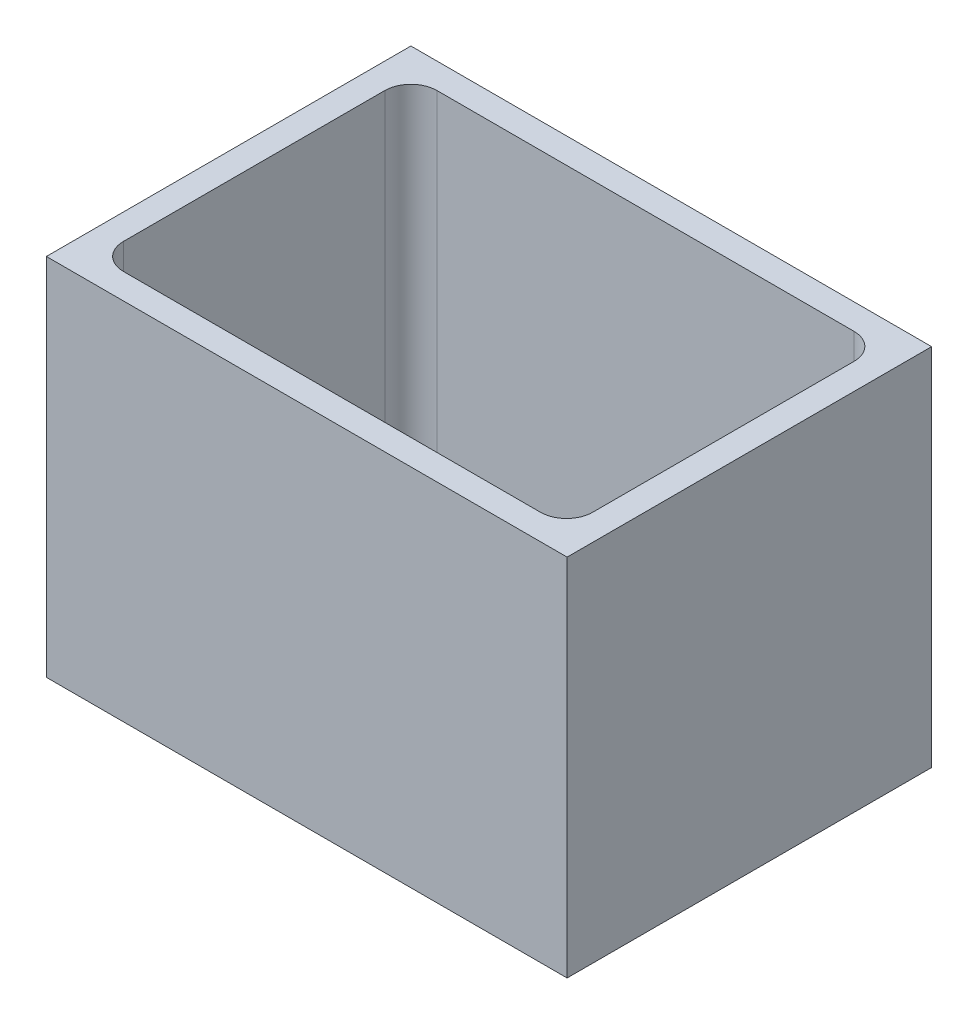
ISO-10303-21;
HEADER;
FILE_DESCRIPTION(('STEP AP214'),'2;1');
FILE_NAME('part.step','',(''),(''),'','','');
FILE_SCHEMA(('AUTOMOTIVE_DESIGN { 1 0 10303 214 1 1 1 1 }'));
ENDSEC;
DATA;
#1=APPLICATION_CONTEXT('core data for automotive mechanical design processes');
#2=APPLICATION_PROTOCOL_DEFINITION('international standard','automotive_design',2000,#1);
#3=PRODUCT_CONTEXT('',#1,'mechanical');
#4=PRODUCT('Part','Part','',(#3));
#5=PRODUCT_RELATED_PRODUCT_CATEGORY('part','',(#4));
#6=PRODUCT_DEFINITION_FORMATION('','',#4);
#7=PRODUCT_DEFINITION_CONTEXT('part definition',#1,'design');
#8=PRODUCT_DEFINITION('design','',#6,#7);
#9=PRODUCT_DEFINITION_SHAPE('','',#8);
#10=(LENGTH_UNIT() NAMED_UNIT(*) SI_UNIT(.MILLI.,.METRE.));
#11=(NAMED_UNIT(*) PLANE_ANGLE_UNIT() SI_UNIT($,.RADIAN.));
#12=(NAMED_UNIT(*) SI_UNIT($,.STERADIAN.) SOLID_ANGLE_UNIT());
#13=UNCERTAINTY_MEASURE_WITH_UNIT(LENGTH_MEASURE(1.E-05),#10,'distance_accuracy_value','');
#14=(GEOMETRIC_REPRESENTATION_CONTEXT(3) GLOBAL_UNCERTAINTY_ASSIGNED_CONTEXT((#13)) GLOBAL_UNIT_ASSIGNED_CONTEXT((#10,
#11,#12)) REPRESENTATION_CONTEXT('',''));
#15=CARTESIAN_POINT('',(0.,0.,0.));
#16=DIRECTION('',(0.,0.,1.));
#17=DIRECTION('',(1.,0.,0.));
#18=AXIS2_PLACEMENT_3D('',#15,#16,#17);
#19=CARTESIAN_POINT('',(-76.2962116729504,88.9,-34.5932753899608));
#20=DIRECTION('',(1.,0.,0.));
#21=DIRECTION('',(0.,0.,-1.));
#22=AXIS2_PLACEMENT_3D('',#19,#20,#21);
#23=PLANE('',#22);
#24=DIRECTION('',(0.,0.,1.));
#25=VECTOR('',#24,1.);
#26=CARTESIAN_POINT('',(-76.2962116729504,0.,-34.5932753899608));
#27=LINE('',#26,#25);
#28=CARTESIAN_POINT('',(-76.2962116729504,0.,-34.5932753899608));
#29=VERTEX_POINT('',#28);
#30=CARTESIAN_POINT('',(-76.2962116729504,0.,54.3067246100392));
#31=VERTEX_POINT('',#30);
#32=EDGE_CURVE('E180',#29,#31,#27,.T.);
#33=ORIENTED_EDGE('',*,*,#32,.T.);
#34=DIRECTION('',(0.,-1.,0.));
#35=VECTOR('',#34,1.);
#36=CARTESIAN_POINT('',(-76.2962116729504,88.9,54.3067246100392));
#37=LINE('',#36,#35);
#38=CARTESIAN_POINT('',(-76.2962116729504,88.9,54.3067246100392));
#39=VERTEX_POINT('',#38);
#40=EDGE_CURVE('E11',#39,#31,#37,.T.);
#41=ORIENTED_EDGE('',*,*,#40,.F.);
#42=DIRECTION('',(0.,0.,1.));
#43=VECTOR('',#42,1.);
#44=CARTESIAN_POINT('',(-76.2962116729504,88.9,-34.5932753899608));
#45=LINE('',#44,#43);
#46=CARTESIAN_POINT('',(-76.2962116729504,88.9,-34.5932753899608));
#47=VERTEX_POINT('',#46);
#48=EDGE_CURVE('E192',#47,#39,#45,.T.);
#49=ORIENTED_EDGE('',*,*,#48,.F.);
#50=DIRECTION('',(0.,-1.,0.));
#51=VECTOR('',#50,1.);
#52=CARTESIAN_POINT('',(-76.2962116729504,88.9,-34.5932753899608));
#53=LINE('',#52,#51);
#54=EDGE_CURVE('E202',#47,#29,#53,.T.);
#55=ORIENTED_EDGE('',*,*,#54,.T.);
#56=EDGE_LOOP('',(#33,#41,#49,#55));
#57=FACE_BOUND('',#56,.T.);
#58=ADVANCED_FACE('F37',(#57),#23,.F.);
#59=CARTESIAN_POINT('',(-76.2962116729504,88.9,54.3067246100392));
#60=DIRECTION('',(0.,0.,-1.));
#61=DIRECTION('',(-1.,0.,0.));
#62=AXIS2_PLACEMENT_3D('',#59,#60,#61);
#63=PLANE('',#62);
#64=DIRECTION('',(1.,0.,0.));
#65=VECTOR('',#64,1.);
#66=CARTESIAN_POINT('',(-76.2962116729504,0.,54.3067246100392));
#67=LINE('',#66,#65);
#68=CARTESIAN_POINT('',(50.7037883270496,0.,54.3067246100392));
#69=VERTEX_POINT('',#68);
#70=EDGE_CURVE('E205',#31,#69,#67,.T.);
#71=ORIENTED_EDGE('',*,*,#70,.T.);
#72=DIRECTION('',(0.,-1.,0.));
#73=VECTOR('',#72,1.);
#74=CARTESIAN_POINT('',(50.7037883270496,88.9,54.3067246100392));
#75=LINE('',#74,#73);
#76=CARTESIAN_POINT('',(50.7037883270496,88.9,54.3067246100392));
#77=VERTEX_POINT('',#76);
#78=EDGE_CURVE('E44',#77,#69,#75,.T.);
#79=ORIENTED_EDGE('',*,*,#78,.F.);
#80=DIRECTION('',(1.,0.,0.));
#81=VECTOR('',#80,1.);
#82=CARTESIAN_POINT('',(-76.2962116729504,88.9,54.3067246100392));
#83=LINE('',#82,#81);
#84=EDGE_CURVE('E195',#39,#77,#83,.T.);
#85=ORIENTED_EDGE('',*,*,#84,.F.);
#86=ORIENTED_EDGE('',*,*,#40,.T.);
#87=EDGE_LOOP('',(#71,#79,#85,#86));
#88=FACE_BOUND('',#87,.T.);
#89=ADVANCED_FACE('F233',(#88),#63,.F.);
#90=CARTESIAN_POINT('',(50.7037883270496,88.9,-34.5932753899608));
#91=DIRECTION('',(-1.,0.,0.));
#92=DIRECTION('',(0.,0.,1.));
#93=AXIS2_PLACEMENT_3D('',#90,#91,#92);
#94=PLANE('',#93);
#95=DIRECTION('',(0.,0.,-1.));
#96=VECTOR('',#95,1.);
#97=CARTESIAN_POINT('',(50.7037883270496,0.,-34.5932753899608));
#98=LINE('',#97,#96);
#99=CARTESIAN_POINT('',(50.7037883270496,0.,-34.5932753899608));
#100=VERTEX_POINT('',#99);
#101=EDGE_CURVE('E207',#69,#100,#98,.T.);
#102=ORIENTED_EDGE('',*,*,#101,.T.);
#103=DIRECTION('',(0.,-1.,0.));
#104=VECTOR('',#103,1.);
#105=CARTESIAN_POINT('',(50.7037883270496,88.9,-34.5932753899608));
#106=LINE('',#105,#104);
#107=CARTESIAN_POINT('',(50.7037883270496,88.9,-34.5932753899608));
#108=VERTEX_POINT('',#107);
#109=EDGE_CURVE('E212',#108,#100,#106,.T.);
#110=ORIENTED_EDGE('',*,*,#109,.F.);
#111=DIRECTION('',(0.,0.,-1.));
#112=VECTOR('',#111,1.);
#113=CARTESIAN_POINT('',(50.7037883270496,88.9,-34.5932753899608));
#114=LINE('',#113,#112);
#115=EDGE_CURVE('E198',#77,#108,#114,.T.);
#116=ORIENTED_EDGE('',*,*,#115,.F.);
#117=ORIENTED_EDGE('',*,*,#78,.T.);
#118=EDGE_LOOP('',(#102,#110,#116,#117));
#119=FACE_BOUND('',#118,.T.);
#120=ADVANCED_FACE('F219',(#119),#94,.F.);
#121=CARTESIAN_POINT('',(-76.2962116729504,88.9,-34.5932753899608));
#122=DIRECTION('',(0.,0.,1.));
#123=DIRECTION('',(1.,0.,0.));
#124=AXIS2_PLACEMENT_3D('',#121,#122,#123);
#125=PLANE('',#124);
#126=DIRECTION('',(-1.,0.,0.));
#127=VECTOR('',#126,1.);
#128=CARTESIAN_POINT('',(-76.2962116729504,0.,-34.5932753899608));
#129=LINE('',#128,#127);
#130=EDGE_CURVE('E196',#100,#29,#129,.T.);
#131=ORIENTED_EDGE('',*,*,#130,.T.);
#132=ORIENTED_EDGE('',*,*,#54,.F.);
#133=DIRECTION('',(-1.,0.,0.));
#134=VECTOR('',#133,1.);
#135=CARTESIAN_POINT('',(-76.2962116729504,88.9,-34.5932753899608));
#136=LINE('',#135,#134);
#137=EDGE_CURVE('E200',#108,#47,#136,.T.);
#138=ORIENTED_EDGE('',*,*,#137,.F.);
#139=ORIENTED_EDGE('',*,*,#109,.T.);
#140=EDGE_LOOP('',(#131,#132,#138,#139));
#141=FACE_BOUND('',#140,.T.);
#142=ADVANCED_FACE('F226',(#141),#125,.F.);
#143=CARTESIAN_POINT('',(0.,88.9,0.));
#144=DIRECTION('',(0.,1.,0.));
#145=DIRECTION('',(0.,0.,1.));
#146=AXIS2_PLACEMENT_3D('',#143,#144,#145);
#147=PLANE('',#146);
#148=CARTESIAN_POINT('',(-63.7232116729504,88.9,-22.0202753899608));
#149=DIRECTION('',(0.,1.,0.));
#150=DIRECTION('',(0.,0.,1.));
#151=AXIS2_PLACEMENT_3D('',#148,#149,#150);
#152=CIRCLE('',#151,6.35);
#153=CARTESIAN_POINT('',(-63.7232116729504,88.9,-28.3702753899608));
#154=VERTEX_POINT('',#153);
#155=CARTESIAN_POINT('',(-70.0732116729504,88.9,-22.0202753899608));
#156=VERTEX_POINT('',#155);
#157=EDGE_CURVE('E51',#154,#156,#152,.T.);
#158=ORIENTED_EDGE('',*,*,#157,.F.);
#159=DIRECTION('',(1.,0.,0.));
#160=VECTOR('',#159,1.);
#161=CARTESIAN_POINT('',(0.,88.9,-28.3702753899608));
#162=LINE('',#161,#160);
#163=CARTESIAN_POINT('',(38.0037883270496,88.9,-28.3702753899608));
#164=VERTEX_POINT('',#163);
#165=EDGE_CURVE('E143',#154,#164,#162,.T.);
#166=ORIENTED_EDGE('',*,*,#165,.T.);
#167=CARTESIAN_POINT('',(38.0037883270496,88.9,-22.0202753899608));
#168=DIRECTION('',(0.,1.,0.));
#169=DIRECTION('',(0.,0.,1.));
#170=AXIS2_PLACEMENT_3D('',#167,#168,#169);
#171=CIRCLE('',#170,6.35);
#172=CARTESIAN_POINT('',(44.3537883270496,88.9,-22.0202753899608));
#173=VERTEX_POINT('',#172);
#174=EDGE_CURVE('E146',#173,#164,#171,.T.);
#175=ORIENTED_EDGE('',*,*,#174,.F.);
#176=DIRECTION('',(0.,0.,1.));
#177=VECTOR('',#176,1.);
#178=CARTESIAN_POINT('',(44.3537883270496,88.9,0.));
#179=LINE('',#178,#177);
#180=CARTESIAN_POINT('',(44.3537883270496,88.9,41.7337246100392));
#181=VERTEX_POINT('',#180);
#182=EDGE_CURVE('E173',#173,#181,#179,.T.);
#183=ORIENTED_EDGE('',*,*,#182,.T.);
#184=CARTESIAN_POINT('',(38.0037883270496,88.9,41.7337246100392));
#185=DIRECTION('',(0.,1.,0.));
#186=DIRECTION('',(0.,0.,1.));
#187=AXIS2_PLACEMENT_3D('',#184,#185,#186);
#188=CIRCLE('',#187,6.35);
#189=CARTESIAN_POINT('',(38.0037883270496,88.9,48.0837246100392));
#190=VERTEX_POINT('',#189);
#191=EDGE_CURVE('E170',#190,#181,#188,.T.);
#192=ORIENTED_EDGE('',*,*,#191,.F.);
#193=DIRECTION('',(1.,0.,0.));
#194=VECTOR('',#193,1.);
#195=CARTESIAN_POINT('',(0.,88.9,48.0837246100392));
#196=LINE('',#195,#194);
#197=CARTESIAN_POINT('',(-63.7232116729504,88.9,48.0837246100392));
#198=VERTEX_POINT('',#197);
#199=EDGE_CURVE('E167',#198,#190,#196,.T.);
#200=ORIENTED_EDGE('',*,*,#199,.F.);
#201=CARTESIAN_POINT('',(-63.7232116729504,88.9,41.7337246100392));
#202=DIRECTION('',(0.,1.,0.));
#203=DIRECTION('',(0.,0.,1.));
#204=AXIS2_PLACEMENT_3D('',#201,#202,#203);
#205=CIRCLE('',#204,6.35);
#206=CARTESIAN_POINT('',(-70.0732116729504,88.9,41.7337246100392));
#207=VERTEX_POINT('',#206);
#208=EDGE_CURVE('E164',#207,#198,#205,.T.);
#209=ORIENTED_EDGE('',*,*,#208,.F.);
#210=DIRECTION('',(0.,0.,1.));
#211=VECTOR('',#210,1.);
#212=CARTESIAN_POINT('',(-70.0732116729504,88.9,0.));
#213=LINE('',#212,#211);
#214=EDGE_CURVE('E162',#156,#207,#213,.T.);
#215=ORIENTED_EDGE('',*,*,#214,.F.);
#216=EDGE_LOOP('',(#158,#166,#175,#183,#192,#200,#209,#215));
#217=FACE_BOUND('',#216,.T.);
#218=ORIENTED_EDGE('',*,*,#48,.T.);
#219=ORIENTED_EDGE('',*,*,#84,.T.);
#220=ORIENTED_EDGE('',*,*,#115,.T.);
#221=ORIENTED_EDGE('',*,*,#137,.T.);
#222=EDGE_LOOP('',(#218,#219,#220,#221));
#223=FACE_BOUND('',#222,.T.);
#224=ADVANCED_FACE('F232',(#217,#223),#147,.T.);
#225=CARTESIAN_POINT('',(0.,0.,0.));
#226=DIRECTION('',(0.,1.,0.));
#227=DIRECTION('',(0.,0.,1.));
#228=AXIS2_PLACEMENT_3D('',#225,#226,#227);
#229=PLANE('',#228);
#230=DIRECTION('',(1.,0.,0.));
#231=VECTOR('',#230,1.);
#232=CARTESIAN_POINT('',(0.,0.,-28.3702753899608));
#233=LINE('',#232,#231);
#234=CARTESIAN_POINT('',(-63.7232116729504,0.,-28.3702753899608));
#235=VERTEX_POINT('',#234);
#236=CARTESIAN_POINT('',(38.0037883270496,0.,-28.3702753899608));
#237=VERTEX_POINT('',#236);
#238=EDGE_CURVE('E133',#235,#237,#233,.T.);
#239=ORIENTED_EDGE('',*,*,#238,.F.);
#240=CARTESIAN_POINT('',(-63.7232116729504,0.,-22.0202753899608));
#241=DIRECTION('',(0.,1.,0.));
#242=DIRECTION('',(0.,0.,1.));
#243=AXIS2_PLACEMENT_3D('',#240,#241,#242);
#244=CIRCLE('',#243,6.35);
#245=CARTESIAN_POINT('',(-70.0732116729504,0.,-22.0202753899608));
#246=VERTEX_POINT('',#245);
#247=EDGE_CURVE('E127',#235,#246,#244,.T.);
#248=ORIENTED_EDGE('',*,*,#247,.T.);
#249=DIRECTION('',(0.,0.,1.));
#250=VECTOR('',#249,1.);
#251=CARTESIAN_POINT('',(-70.0732116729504,0.,0.));
#252=LINE('',#251,#250);
#253=CARTESIAN_POINT('',(-70.0732116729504,0.,41.7337246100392));
#254=VERTEX_POINT('',#253);
#255=EDGE_CURVE('E136',#246,#254,#252,.T.);
#256=ORIENTED_EDGE('',*,*,#255,.T.);
#257=CARTESIAN_POINT('',(-63.7232116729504,0.,41.7337246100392));
#258=DIRECTION('',(0.,1.,0.));
#259=DIRECTION('',(0.,0.,1.));
#260=AXIS2_PLACEMENT_3D('',#257,#258,#259);
#261=CIRCLE('',#260,6.35);
#262=CARTESIAN_POINT('',(-63.7232116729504,0.,48.0837246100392));
#263=VERTEX_POINT('',#262);
#264=EDGE_CURVE('E59',#254,#263,#261,.T.);
#265=ORIENTED_EDGE('',*,*,#264,.T.);
#266=DIRECTION('',(1.,0.,0.));
#267=VECTOR('',#266,1.);
#268=CARTESIAN_POINT('',(0.,0.,48.0837246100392));
#269=LINE('',#268,#267);
#270=CARTESIAN_POINT('',(38.0037883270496,0.,48.0837246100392));
#271=VERTEX_POINT('',#270);
#272=EDGE_CURVE('E150',#263,#271,#269,.T.);
#273=ORIENTED_EDGE('',*,*,#272,.T.);
#274=CARTESIAN_POINT('',(38.0037883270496,0.,41.7337246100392));
#275=DIRECTION('',(0.,1.,0.));
#276=DIRECTION('',(0.,0.,1.));
#277=AXIS2_PLACEMENT_3D('',#274,#275,#276);
#278=CIRCLE('',#277,6.35);
#279=CARTESIAN_POINT('',(44.3537883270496,0.,41.7337246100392));
#280=VERTEX_POINT('',#279);
#281=EDGE_CURVE('E153',#271,#280,#278,.T.);
#282=ORIENTED_EDGE('',*,*,#281,.T.);
#283=DIRECTION('',(0.,0.,1.));
#284=VECTOR('',#283,1.);
#285=CARTESIAN_POINT('',(44.3537883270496,0.,0.));
#286=LINE('',#285,#284);
#287=CARTESIAN_POINT('',(44.3537883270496,0.,-22.0202753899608));
#288=VERTEX_POINT('',#287);
#289=EDGE_CURVE('E156',#288,#280,#286,.T.);
#290=ORIENTED_EDGE('',*,*,#289,.F.);
#291=CARTESIAN_POINT('',(38.0037883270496,0.,-22.0202753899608));
#292=DIRECTION('',(0.,1.,0.));
#293=DIRECTION('',(0.,0.,1.));
#294=AXIS2_PLACEMENT_3D('',#291,#292,#293);
#295=CIRCLE('',#294,6.35);
#296=EDGE_CURVE('E158',#288,#237,#295,.T.);
#297=ORIENTED_EDGE('',*,*,#296,.T.);
#298=EDGE_LOOP('',(#239,#248,#256,#265,#273,#282,#290,#297));
#299=FACE_BOUND('',#298,.T.);
#300=ORIENTED_EDGE('',*,*,#32,.F.);
#301=ORIENTED_EDGE('',*,*,#130,.F.);
#302=ORIENTED_EDGE('',*,*,#101,.F.);
#303=ORIENTED_EDGE('',*,*,#70,.F.);
#304=EDGE_LOOP('',(#300,#301,#302,#303));
#305=FACE_BOUND('',#304,.T.);
#306=ADVANCED_FACE('F140',(#299,#305),#229,.F.);
#307=CARTESIAN_POINT('',(-63.7232116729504,0.,-22.0202753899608));
#308=DIRECTION('',(0.,1.,0.));
#309=DIRECTION('',(0.,0.,1.));
#310=AXIS2_PLACEMENT_3D('',#307,#308,#309);
#311=CYLINDRICAL_SURFACE('',#310,6.35);
#312=ORIENTED_EDGE('',*,*,#157,.T.);
#313=DIRECTION('',(0.,1.,0.));
#314=VECTOR('',#313,1.);
#315=CARTESIAN_POINT('',(-70.0732116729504,0.,-22.0202753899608));
#316=LINE('',#315,#314);
#317=EDGE_CURVE('E123',#246,#156,#316,.T.);
#318=ORIENTED_EDGE('',*,*,#317,.F.);
#319=ORIENTED_EDGE('',*,*,#247,.F.);
#320=DIRECTION('',(0.,1.,0.));
#321=VECTOR('',#320,1.);
#322=CARTESIAN_POINT('',(-63.7232116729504,0.,-28.3702753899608));
#323=LINE('',#322,#321);
#324=EDGE_CURVE('E178',#235,#154,#323,.T.);
#325=ORIENTED_EDGE('',*,*,#324,.T.);
#326=EDGE_LOOP('',(#312,#318,#319,#325));
#327=FACE_BOUND('',#326,.T.);
#328=ADVANCED_FACE('F125',(#327),#311,.F.);
#329=CARTESIAN_POINT('',(0.,0.,-28.3702753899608));
#330=DIRECTION('',(0.,0.,1.));
#331=DIRECTION('',(1.,0.,0.));
#332=AXIS2_PLACEMENT_3D('',#329,#330,#331);
#333=PLANE('',#332);
#334=ORIENTED_EDGE('',*,*,#165,.F.);
#335=ORIENTED_EDGE('',*,*,#324,.F.);
#336=ORIENTED_EDGE('',*,*,#238,.T.);
#337=DIRECTION('',(0.,1.,0.));
#338=VECTOR('',#337,1.);
#339=CARTESIAN_POINT('',(38.0037883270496,0.,-28.3702753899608));
#340=LINE('',#339,#338);
#341=EDGE_CURVE('E181',#237,#164,#340,.T.);
#342=ORIENTED_EDGE('',*,*,#341,.T.);
#343=EDGE_LOOP('',(#334,#335,#336,#342));
#344=FACE_BOUND('',#343,.T.);
#345=ADVANCED_FACE('F250',(#344),#333,.T.);
#346=CARTESIAN_POINT('',(38.0037883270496,0.,-22.0202753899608));
#347=DIRECTION('',(0.,1.,0.));
#348=DIRECTION('',(0.,0.,1.));
#349=AXIS2_PLACEMENT_3D('',#346,#347,#348);
#350=CYLINDRICAL_SURFACE('',#349,6.35);
#351=ORIENTED_EDGE('',*,*,#174,.T.);
#352=ORIENTED_EDGE('',*,*,#341,.F.);
#353=ORIENTED_EDGE('',*,*,#296,.F.);
#354=DIRECTION('',(0.,1.,0.));
#355=VECTOR('',#354,1.);
#356=CARTESIAN_POINT('',(44.3537883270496,0.,-22.0202753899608));
#357=LINE('',#356,#355);
#358=EDGE_CURVE('E183',#288,#173,#357,.T.);
#359=ORIENTED_EDGE('',*,*,#358,.T.);
#360=EDGE_LOOP('',(#351,#352,#353,#359));
#361=FACE_BOUND('',#360,.T.);
#362=ADVANCED_FACE('F267',(#361),#350,.F.);
#363=CARTESIAN_POINT('',(44.3537883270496,0.,0.));
#364=DIRECTION('',(-1.,0.,0.));
#365=DIRECTION('',(0.,0.,1.));
#366=AXIS2_PLACEMENT_3D('',#363,#364,#365);
#367=PLANE('',#366);
#368=ORIENTED_EDGE('',*,*,#182,.F.);
#369=ORIENTED_EDGE('',*,*,#358,.F.);
#370=ORIENTED_EDGE('',*,*,#289,.T.);
#371=DIRECTION('',(0.,1.,0.));
#372=VECTOR('',#371,1.);
#373=CARTESIAN_POINT('',(44.3537883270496,0.,41.7337246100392));
#374=LINE('',#373,#372);
#375=EDGE_CURVE('E185',#280,#181,#374,.T.);
#376=ORIENTED_EDGE('',*,*,#375,.T.);
#377=EDGE_LOOP('',(#368,#369,#370,#376));
#378=FACE_BOUND('',#377,.T.);
#379=ADVANCED_FACE('F263',(#378),#367,.T.);
#380=CARTESIAN_POINT('',(38.0037883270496,0.,41.7337246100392));
#381=DIRECTION('',(0.,1.,0.));
#382=DIRECTION('',(0.,0.,1.));
#383=AXIS2_PLACEMENT_3D('',#380,#381,#382);
#384=CYLINDRICAL_SURFACE('',#383,6.35);
#385=ORIENTED_EDGE('',*,*,#191,.T.);
#386=ORIENTED_EDGE('',*,*,#375,.F.);
#387=ORIENTED_EDGE('',*,*,#281,.F.);
#388=DIRECTION('',(0.,1.,0.));
#389=VECTOR('',#388,1.);
#390=CARTESIAN_POINT('',(38.0037883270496,0.,48.0837246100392));
#391=LINE('',#390,#389);
#392=EDGE_CURVE('E187',#271,#190,#391,.T.);
#393=ORIENTED_EDGE('',*,*,#392,.T.);
#394=EDGE_LOOP('',(#385,#386,#387,#393));
#395=FACE_BOUND('',#394,.T.);
#396=ADVANCED_FACE('F259',(#395),#384,.F.);
#397=CARTESIAN_POINT('',(0.,0.,48.0837246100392));
#398=DIRECTION('',(0.,0.,1.));
#399=DIRECTION('',(1.,0.,0.));
#400=AXIS2_PLACEMENT_3D('',#397,#398,#399);
#401=PLANE('',#400);
#402=ORIENTED_EDGE('',*,*,#199,.T.);
#403=ORIENTED_EDGE('',*,*,#392,.F.);
#404=ORIENTED_EDGE('',*,*,#272,.F.);
#405=DIRECTION('',(0.,1.,0.));
#406=VECTOR('',#405,1.);
#407=CARTESIAN_POINT('',(-63.7232116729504,0.,48.0837246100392));
#408=LINE('',#407,#406);
#409=EDGE_CURVE('E189',#263,#198,#408,.T.);
#410=ORIENTED_EDGE('',*,*,#409,.T.);
#411=EDGE_LOOP('',(#402,#403,#404,#410));
#412=FACE_BOUND('',#411,.T.);
#413=ADVANCED_FACE('F256',(#412),#401,.F.);
#414=CARTESIAN_POINT('',(-63.7232116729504,0.,41.7337246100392));
#415=DIRECTION('',(0.,1.,0.));
#416=DIRECTION('',(0.,0.,1.));
#417=AXIS2_PLACEMENT_3D('',#414,#415,#416);
#418=CYLINDRICAL_SURFACE('',#417,6.35);
#419=ORIENTED_EDGE('',*,*,#208,.T.);
#420=ORIENTED_EDGE('',*,*,#409,.F.);
#421=ORIENTED_EDGE('',*,*,#264,.F.);
#422=DIRECTION('',(0.,1.,0.));
#423=VECTOR('',#422,1.);
#424=CARTESIAN_POINT('',(-70.0732116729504,0.,41.7337246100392));
#425=LINE('',#424,#423);
#426=EDGE_CURVE('E132',#254,#207,#425,.T.);
#427=ORIENTED_EDGE('',*,*,#426,.T.);
#428=EDGE_LOOP('',(#419,#420,#421,#427));
#429=FACE_BOUND('',#428,.T.);
#430=ADVANCED_FACE('F253',(#429),#418,.F.);
#431=CARTESIAN_POINT('',(-70.0732116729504,0.,0.));
#432=DIRECTION('',(-1.,0.,0.));
#433=DIRECTION('',(0.,0.,1.));
#434=AXIS2_PLACEMENT_3D('',#431,#432,#433);
#435=PLANE('',#434);
#436=ORIENTED_EDGE('',*,*,#214,.T.);
#437=ORIENTED_EDGE('',*,*,#426,.F.);
#438=ORIENTED_EDGE('',*,*,#255,.F.);
#439=ORIENTED_EDGE('',*,*,#317,.T.);
#440=EDGE_LOOP('',(#436,#437,#438,#439));
#441=FACE_BOUND('',#440,.T.);
#442=ADVANCED_FACE('F137',(#441),#435,.F.);
#443=CLOSED_SHELL('',(#58,#89,#120,#142,#224,#306,#328,#345,#362,#379,#396,#413,#430,#442));
#444=MANIFOLD_SOLID_BREP('B2',#443);
#445=ADVANCED_BREP_SHAPE_REPRESENTATION('',(#18,#444),#14);
#446=SHAPE_DEFINITION_REPRESENTATION(#9,#445);
ENDSEC;
END-ISO-10303-21;
